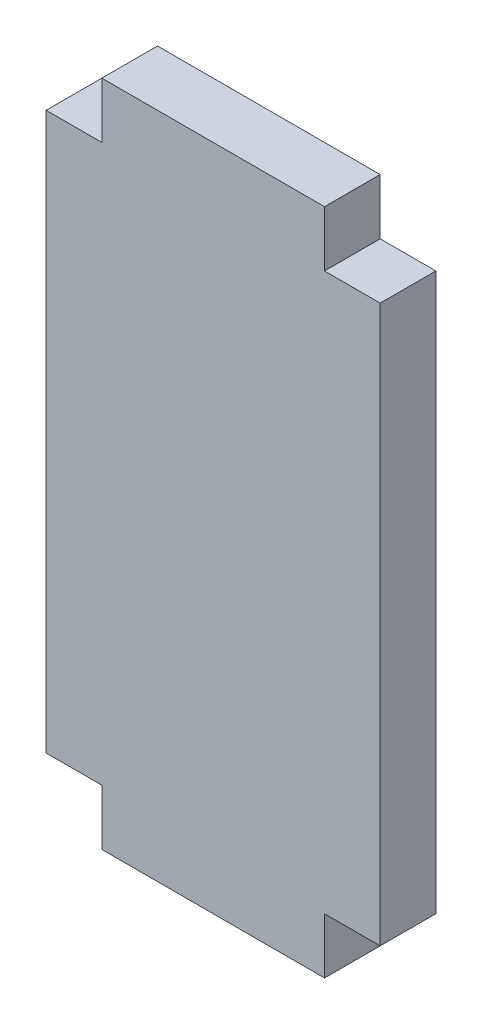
from build123d import *

# Parameters (mm, degrees)
SKETCH1_W           = 19.05
SKETCH1_H           = 38.1
BOSS_EXTRUDE1_DEPTH = 1.5875
SKETCH2_W           = 3.175
SKETCH2_H           = 3.175
CUT_EXTRUDE1_DEPTH  = 22.533897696


with BuildPart() as part:
    # Sketch1 → Boss-Extrude1 (new, symmetric)
    with BuildSketch(Plane.XY):
        Rectangle(SKETCH1_W, SKETCH1_H)
    extrude(amount=BOSS_EXTRUDE1_DEPTH, both=True)

    # Sketch2 → Cut-Extrude1 (cut, through all)
    with BuildSketch(Plane.XY.offset(1.5875)):
        with Locations((-7.9375, 17.4625)):
            Rectangle(SKETCH2_W, SKETCH2_H)
        with Locations((7.9375, 17.4625)):
            Rectangle(SKETCH2_W, SKETCH2_H)
        with Locations((7.9375, -17.4625)):
            Rectangle(SKETCH2_W, SKETCH2_H)
        with Locations((-7.9375, -17.4625)):
            Rectangle(SKETCH2_W, SKETCH2_H)
    extrude(amount=-CUT_EXTRUDE1_DEPTH, mode=Mode.SUBTRACT)


solid = part.part
